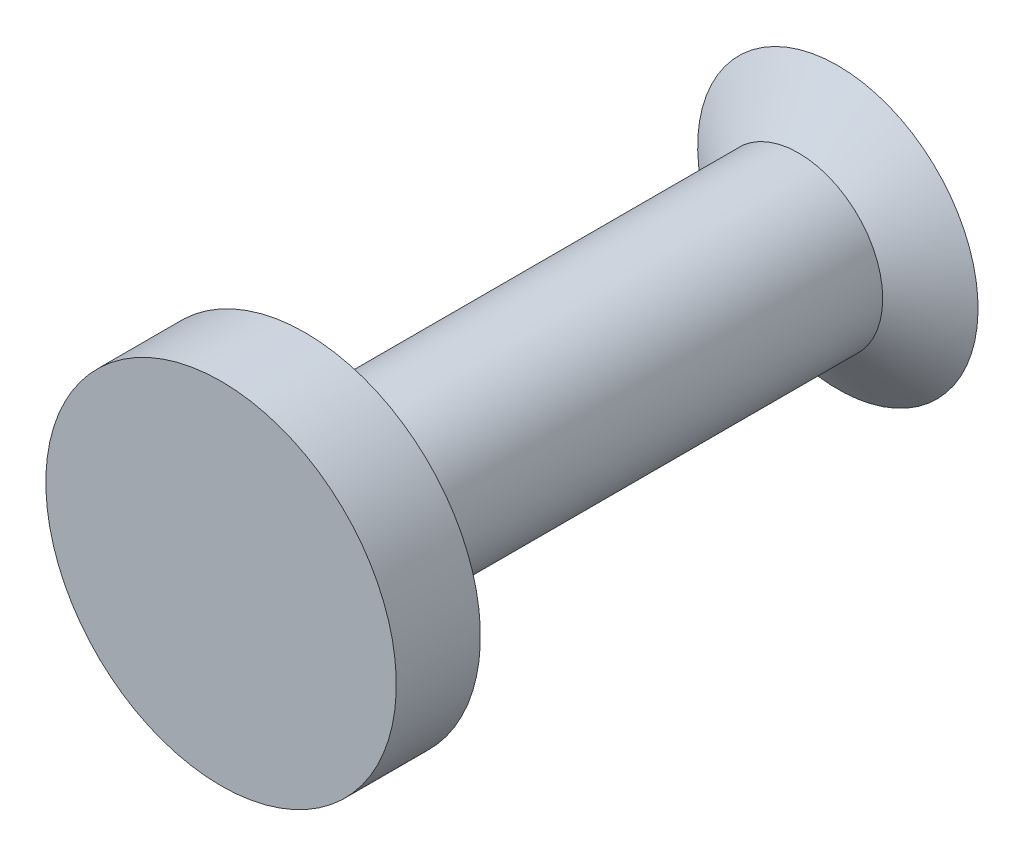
from build123d import *


with BuildPart() as part:
    # Sketch1 → Revolve1 (revolve)
    with BuildSketch(Plane(origin=(0, 0, 0), x_dir=(0, 0, -1), z_dir=(1, 0, 0))):
        Polygon((0, 0), (-5.588, 0), (-5.588, 1.5875), (-4.826, 1.5875), (-4.826, 0.762), (-0.355705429, 0.762), (0, 1.27), align=None)
    revolve(axis=Axis((0, 0, 0), (0, 0, 1)))


solid = part.part
